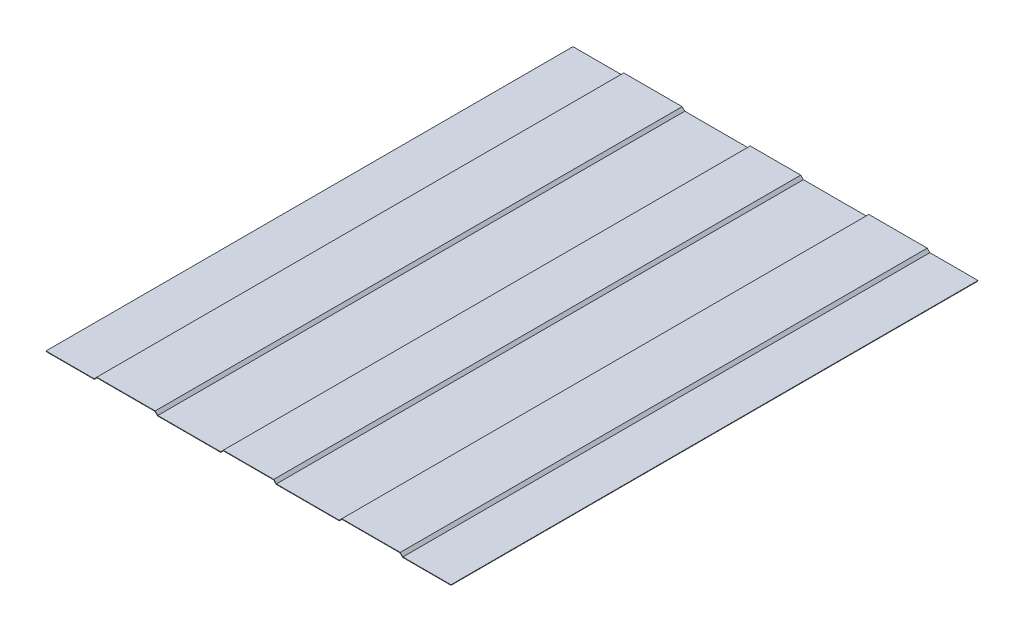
ISO-10303-21;
HEADER;
FILE_DESCRIPTION(('STEP AP214'),'2;1');
FILE_NAME('part.step','',(''),(''),'','','');
FILE_SCHEMA(('AUTOMOTIVE_DESIGN { 1 0 10303 214 1 1 1 1 }'));
ENDSEC;
DATA;
#1=APPLICATION_CONTEXT('core data for automotive mechanical design processes');
#2=APPLICATION_PROTOCOL_DEFINITION('international standard','automotive_design',2000,#1);
#3=PRODUCT_CONTEXT('',#1,'mechanical');
#4=PRODUCT('Part','Part','',(#3));
#5=PRODUCT_RELATED_PRODUCT_CATEGORY('part','',(#4));
#6=PRODUCT_DEFINITION_FORMATION('','',#4);
#7=PRODUCT_DEFINITION_CONTEXT('part definition',#1,'design');
#8=PRODUCT_DEFINITION('design','',#6,#7);
#9=PRODUCT_DEFINITION_SHAPE('','',#8);
#10=(LENGTH_UNIT() NAMED_UNIT(*) SI_UNIT(.MILLI.,.METRE.));
#11=(NAMED_UNIT(*) PLANE_ANGLE_UNIT() SI_UNIT($,.RADIAN.));
#12=(NAMED_UNIT(*) SI_UNIT($,.STERADIAN.) SOLID_ANGLE_UNIT());
#13=UNCERTAINTY_MEASURE_WITH_UNIT(LENGTH_MEASURE(1.E-05),#10,'distance_accuracy_value','');
#14=(GEOMETRIC_REPRESENTATION_CONTEXT(3) GLOBAL_UNCERTAINTY_ASSIGNED_CONTEXT((#13)) GLOBAL_UNIT_ASSIGNED_CONTEXT((#10,
#11,#12)) REPRESENTATION_CONTEXT('',''));
#15=CARTESIAN_POINT('',(0.,0.,0.));
#16=DIRECTION('',(0.,0.,1.));
#17=DIRECTION('',(1.,0.,0.));
#18=AXIS2_PLACEMENT_3D('',#15,#16,#17);
#19=CARTESIAN_POINT('',(-384.25,1.,1768.52342189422));
#20=DIRECTION('',(0.,-1.,0.));
#21=DIRECTION('',(1.,0.,0.));
#22=AXIS2_PLACEMENT_3D('',#19,#20,#21);
#23=PLANE('',#22);
#24=DIRECTION('',(-1.,0.,0.));
#25=VECTOR('',#24,1.);
#26=CARTESIAN_POINT('',(-384.250000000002,1.,999.999999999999));
#27=LINE('',#26,#25);
#28=CARTESIAN_POINT('',(-292.914213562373,1.00000000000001,999.999999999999));
#29=VERTEX_POINT('',#28);
#30=CARTESIAN_POINT('',(-384.25,1.,999.999999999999));
#31=VERTEX_POINT('',#30);
#32=EDGE_CURVE('E262',#29,#31,#27,.T.);
#33=ORIENTED_EDGE('',*,*,#32,.F.);
#34=DIRECTION('',(0.,0.,-1.));
#35=VECTOR('',#34,1.);
#36=CARTESIAN_POINT('',(-292.914213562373,1.,1768.52342189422));
#37=LINE('',#36,#35);
#38=CARTESIAN_POINT('',(-292.914213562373,1.,0.));
#39=VERTEX_POINT('',#38);
#40=EDGE_CURVE('E30',#29,#39,#37,.T.);
#41=ORIENTED_EDGE('',*,*,#40,.T.);
#42=DIRECTION('',(-1.,0.,0.));
#43=VECTOR('',#42,1.);
#44=CARTESIAN_POINT('',(-384.25,1.,0.));
#45=LINE('',#44,#43);
#46=CARTESIAN_POINT('',(-384.25,1.,0.));
#47=VERTEX_POINT('',#46);
#48=EDGE_CURVE('E306',#39,#47,#45,.T.);
#49=ORIENTED_EDGE('',*,*,#48,.T.);
#50=DIRECTION('',(0.,0.,-1.));
#51=VECTOR('',#50,1.);
#52=CARTESIAN_POINT('',(-384.25,1.,1768.52342189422));
#53=LINE('',#52,#51);
#54=EDGE_CURVE('E161',#31,#47,#53,.T.);
#55=ORIENTED_EDGE('',*,*,#54,.F.);
#56=EDGE_LOOP('',(#33,#41,#49,#55));
#57=FACE_BOUND('',#56,.T.);
#58=ADVANCED_FACE('F26',(#57),#23,.F.);
#59=CARTESIAN_POINT('',(-384.25,0.,1768.52342189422));
#60=DIRECTION('',(-1.,0.,0.));
#61=DIRECTION('',(0.,0.,1.));
#62=AXIS2_PLACEMENT_3D('',#59,#60,#61);
#63=PLANE('',#62);
#64=DIRECTION('',(0.,0.,-1.));
#65=VECTOR('',#64,1.);
#66=CARTESIAN_POINT('',(-384.25,0.,1768.52342189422));
#67=LINE('',#66,#65);
#68=CARTESIAN_POINT('',(-384.25,0.,999.999999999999));
#69=VERTEX_POINT('',#68);
#70=CARTESIAN_POINT('',(-384.25,0.,0.));
#71=VERTEX_POINT('',#70);
#72=EDGE_CURVE('E302',#69,#71,#67,.T.);
#73=ORIENTED_EDGE('',*,*,#72,.F.);
#74=DIRECTION('',(0.,1.,0.));
#75=VECTOR('',#74,1.);
#76=CARTESIAN_POINT('',(-384.25,1.06654049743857E-13,999.999999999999));
#77=LINE('',#76,#75);
#78=EDGE_CURVE('E168',#69,#31,#77,.T.);
#79=ORIENTED_EDGE('',*,*,#78,.T.);
#80=ORIENTED_EDGE('',*,*,#54,.T.);
#81=DIRECTION('',(0.,1.,0.));
#82=VECTOR('',#81,1.);
#83=CARTESIAN_POINT('',(-384.25,0.,0.));
#84=LINE('',#83,#82);
#85=EDGE_CURVE('E311',#71,#47,#84,.T.);
#86=ORIENTED_EDGE('',*,*,#85,.F.);
#87=EDGE_LOOP('',(#73,#79,#80,#86));
#88=FACE_BOUND('',#87,.T.);
#89=ADVANCED_FACE('F428',(#88),#63,.T.);
#90=CARTESIAN_POINT('',(-384.25,0.,1768.52342189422));
#91=DIRECTION('',(0.,-1.,0.));
#92=DIRECTION('',(1.,0.,0.));
#93=AXIS2_PLACEMENT_3D('',#90,#91,#92);
#94=PLANE('',#93);
#95=DIRECTION('',(0.,0.,-1.));
#96=VECTOR('',#95,1.);
#97=CARTESIAN_POINT('',(-292.5,0.,1768.52342189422));
#98=LINE('',#97,#96);
#99=CARTESIAN_POINT('',(-292.5,0.,999.999999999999));
#100=VERTEX_POINT('',#99);
#101=CARTESIAN_POINT('',(-292.5,0.,0.));
#102=VERTEX_POINT('',#101);
#103=EDGE_CURVE('E299',#100,#102,#98,.T.);
#104=ORIENTED_EDGE('',*,*,#103,.F.);
#105=DIRECTION('',(-1.,0.,0.));
#106=VECTOR('',#105,1.);
#107=CARTESIAN_POINT('',(-384.250000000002,0.,999.999999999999));
#108=LINE('',#107,#106);
#109=EDGE_CURVE('E303',#100,#69,#108,.T.);
#110=ORIENTED_EDGE('',*,*,#109,.T.);
#111=ORIENTED_EDGE('',*,*,#72,.T.);
#112=DIRECTION('',(-1.,0.,0.));
#113=VECTOR('',#112,1.);
#114=CARTESIAN_POINT('',(-384.25,0.,0.));
#115=LINE('',#114,#113);
#116=EDGE_CURVE('E418',#102,#71,#115,.T.);
#117=ORIENTED_EDGE('',*,*,#116,.F.);
#118=EDGE_LOOP('',(#104,#110,#111,#117));
#119=FACE_BOUND('',#118,.T.);
#120=ADVANCED_FACE('F434',(#119),#94,.T.);
#121=CARTESIAN_POINT('',(-292.5,0.,1768.52342189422));
#122=DIRECTION('',(0.707106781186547,-0.707106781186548,0.));
#123=DIRECTION('',(0.707106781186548,0.707106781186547,0.));
#124=AXIS2_PLACEMENT_3D('',#121,#122,#123);
#125=PLANE('',#124);
#126=DIRECTION('',(0.,0.,-1.));
#127=VECTOR('',#126,1.);
#128=CARTESIAN_POINT('',(-287.5,5.,1768.52342189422));
#129=LINE('',#128,#127);
#130=CARTESIAN_POINT('',(-287.5,5.,999.999999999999));
#131=VERTEX_POINT('',#130);
#132=CARTESIAN_POINT('',(-287.5,5.,0.));
#133=VERTEX_POINT('',#132);
#134=EDGE_CURVE('E296',#131,#133,#129,.T.);
#135=ORIENTED_EDGE('',*,*,#134,.F.);
#136=DIRECTION('',(-0.707106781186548,-0.707106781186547,0.));
#137=VECTOR('',#136,1.);
#138=CARTESIAN_POINT('',(-292.500000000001,-8.77850298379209E-13,999.999999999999));
#139=LINE('',#138,#137);
#140=EDGE_CURVE('E300',#131,#100,#139,.T.);
#141=ORIENTED_EDGE('',*,*,#140,.T.);
#142=ORIENTED_EDGE('',*,*,#103,.T.);
#143=DIRECTION('',(-0.707106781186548,-0.707106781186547,0.));
#144=VECTOR('',#143,1.);
#145=CARTESIAN_POINT('',(-292.5,0.,0.));
#146=LINE('',#145,#144);
#147=EDGE_CURVE('E415',#133,#102,#146,.T.);
#148=ORIENTED_EDGE('',*,*,#147,.F.);
#149=EDGE_LOOP('',(#135,#141,#142,#148));
#150=FACE_BOUND('',#149,.T.);
#151=ADVANCED_FACE('F438',(#150),#125,.T.);
#152=CARTESIAN_POINT('',(-287.5,5.,1768.52342189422));
#153=DIRECTION('',(0.,-1.,0.));
#154=DIRECTION('',(0.,0.,-1.));
#155=AXIS2_PLACEMENT_3D('',#152,#153,#154);
#156=PLANE('',#155);
#157=DIRECTION('',(0.,0.,-1.));
#158=VECTOR('',#157,1.);
#159=CARTESIAN_POINT('',(-177.5,5.,1768.52342189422));
#160=LINE('',#159,#158);
#161=CARTESIAN_POINT('',(-177.5,5.,999.999999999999));
#162=VERTEX_POINT('',#161);
#163=CARTESIAN_POINT('',(-177.5,5.,0.));
#164=VERTEX_POINT('',#163);
#165=EDGE_CURVE('E293',#162,#164,#160,.T.);
#166=ORIENTED_EDGE('',*,*,#165,.F.);
#167=DIRECTION('',(-1.,0.,0.));
#168=VECTOR('',#167,1.);
#169=CARTESIAN_POINT('',(-287.500000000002,5.,999.999999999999));
#170=LINE('',#169,#168);
#171=EDGE_CURVE('E297',#162,#131,#170,.T.);
#172=ORIENTED_EDGE('',*,*,#171,.T.);
#173=ORIENTED_EDGE('',*,*,#134,.T.);
#174=DIRECTION('',(-1.,0.,0.));
#175=VECTOR('',#174,1.);
#176=CARTESIAN_POINT('',(-287.5,5.,0.));
#177=LINE('',#176,#175);
#178=EDGE_CURVE('E412',#164,#133,#177,.T.);
#179=ORIENTED_EDGE('',*,*,#178,.F.);
#180=EDGE_LOOP('',(#166,#172,#173,#179));
#181=FACE_BOUND('',#180,.T.);
#182=ADVANCED_FACE('F442',(#181),#156,.T.);
#183=CARTESIAN_POINT('',(-177.5,5.,1768.52342189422));
#184=DIRECTION('',(-0.707106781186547,-0.707106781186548,0.));
#185=DIRECTION('',(0.707106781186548,-0.707106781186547,0.));
#186=AXIS2_PLACEMENT_3D('',#183,#184,#185);
#187=PLANE('',#186);
#188=DIRECTION('',(0.,0.,-1.));
#189=VECTOR('',#188,1.);
#190=CARTESIAN_POINT('',(-172.5,0.,1768.52342189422));
#191=LINE('',#190,#189);
#192=CARTESIAN_POINT('',(-172.5,0.,999.999999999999));
#193=VERTEX_POINT('',#192);
#194=CARTESIAN_POINT('',(-172.5,0.,0.));
#195=VERTEX_POINT('',#194);
#196=EDGE_CURVE('E290',#193,#195,#191,.T.);
#197=ORIENTED_EDGE('',*,*,#196,.F.);
#198=DIRECTION('',(-0.707106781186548,0.707106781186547,0.));
#199=VECTOR('',#198,1.);
#200=CARTESIAN_POINT('',(-177.500000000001,5.00000000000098,999.999999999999));
#201=LINE('',#200,#199);
#202=EDGE_CURVE('E294',#193,#162,#201,.T.);
#203=ORIENTED_EDGE('',*,*,#202,.T.);
#204=ORIENTED_EDGE('',*,*,#165,.T.);
#205=DIRECTION('',(-0.707106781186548,0.707106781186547,0.));
#206=VECTOR('',#205,1.);
#207=CARTESIAN_POINT('',(-177.5,5.,0.));
#208=LINE('',#207,#206);
#209=EDGE_CURVE('E409',#195,#164,#208,.T.);
#210=ORIENTED_EDGE('',*,*,#209,.F.);
#211=EDGE_LOOP('',(#197,#203,#204,#210));
#212=FACE_BOUND('',#211,.T.);
#213=ADVANCED_FACE('F448',(#212),#187,.T.);
#214=CARTESIAN_POINT('',(-172.5,0.,1768.52342189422));
#215=DIRECTION('',(0.,-1.,0.));
#216=DIRECTION('',(0.,0.,-1.));
#217=AXIS2_PLACEMENT_3D('',#214,#215,#216);
#218=PLANE('',#217);
#219=DIRECTION('',(0.,0.,-1.));
#220=VECTOR('',#219,1.);
#221=CARTESIAN_POINT('',(-52.5,0.,1768.52342189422));
#222=LINE('',#221,#220);
#223=CARTESIAN_POINT('',(-52.5,0.,999.999999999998));
#224=VERTEX_POINT('',#223);
#225=CARTESIAN_POINT('',(-52.5,0.,0.));
#226=VERTEX_POINT('',#225);
#227=EDGE_CURVE('E287',#224,#226,#222,.T.);
#228=ORIENTED_EDGE('',*,*,#227,.F.);
#229=DIRECTION('',(-1.,0.,0.));
#230=VECTOR('',#229,1.);
#231=CARTESIAN_POINT('',(-172.500000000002,0.,999.999999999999));
#232=LINE('',#231,#230);
#233=EDGE_CURVE('E291',#224,#193,#232,.T.);
#234=ORIENTED_EDGE('',*,*,#233,.T.);
#235=ORIENTED_EDGE('',*,*,#196,.T.);
#236=DIRECTION('',(-1.,0.,0.));
#237=VECTOR('',#236,1.);
#238=CARTESIAN_POINT('',(-172.5,0.,0.));
#239=LINE('',#238,#237);
#240=EDGE_CURVE('E406',#226,#195,#239,.T.);
#241=ORIENTED_EDGE('',*,*,#240,.F.);
#242=EDGE_LOOP('',(#228,#234,#235,#241));
#243=FACE_BOUND('',#242,.T.);
#244=ADVANCED_FACE('F453',(#243),#218,.T.);
#245=CARTESIAN_POINT('',(-52.5,0.,1768.52342189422));
#246=DIRECTION('',(0.707106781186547,-0.707106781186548,0.));
#247=DIRECTION('',(0.707106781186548,0.707106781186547,0.));
#248=AXIS2_PLACEMENT_3D('',#245,#246,#247);
#249=PLANE('',#248);
#250=DIRECTION('',(0.,0.,-1.));
#251=VECTOR('',#250,1.);
#252=CARTESIAN_POINT('',(-47.5,5.,1768.52342189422));
#253=LINE('',#252,#251);
#254=CARTESIAN_POINT('',(-47.5,5.,999.999999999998));
#255=VERTEX_POINT('',#254);
#256=CARTESIAN_POINT('',(-47.5,5.,0.));
#257=VERTEX_POINT('',#256);
#258=EDGE_CURVE('E284',#255,#257,#253,.T.);
#259=ORIENTED_EDGE('',*,*,#258,.F.);
#260=DIRECTION('',(-0.707106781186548,-0.707106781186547,0.));
#261=VECTOR('',#260,1.);
#262=CARTESIAN_POINT('',(-52.5000000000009,-8.7785029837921E-13,999.999999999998));
#263=LINE('',#262,#261);
#264=EDGE_CURVE('E288',#255,#224,#263,.T.);
#265=ORIENTED_EDGE('',*,*,#264,.T.);
#266=ORIENTED_EDGE('',*,*,#227,.T.);
#267=DIRECTION('',(-0.707106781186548,-0.707106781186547,0.));
#268=VECTOR('',#267,1.);
#269=CARTESIAN_POINT('',(-52.5,0.,0.));
#270=LINE('',#269,#268);
#271=EDGE_CURVE('E403',#257,#226,#270,.T.);
#272=ORIENTED_EDGE('',*,*,#271,.F.);
#273=EDGE_LOOP('',(#259,#265,#266,#272));
#274=FACE_BOUND('',#273,.T.);
#275=ADVANCED_FACE('F457',(#274),#249,.T.);
#276=CARTESIAN_POINT('',(-47.5,5.,1768.52342189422));
#277=DIRECTION('',(0.,-1.,0.));
#278=DIRECTION('',(1.,0.,0.));
#279=AXIS2_PLACEMENT_3D('',#276,#277,#278);
#280=PLANE('',#279);
#281=DIRECTION('',(0.,0.,-1.));
#282=VECTOR('',#281,1.);
#283=CARTESIAN_POINT('',(47.5,5.,1768.52342189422));
#284=LINE('',#283,#282);
#285=CARTESIAN_POINT('',(47.5,5.,999.999999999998));
#286=VERTEX_POINT('',#285);
#287=CARTESIAN_POINT('',(47.5,5.,0.));
#288=VERTEX_POINT('',#287);
#289=EDGE_CURVE('E281',#286,#288,#284,.T.);
#290=ORIENTED_EDGE('',*,*,#289,.F.);
#291=DIRECTION('',(-1.,0.,0.));
#292=VECTOR('',#291,1.);
#293=CARTESIAN_POINT('',(-47.5000000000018,5.,999.999999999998));
#294=LINE('',#293,#292);
#295=EDGE_CURVE('E285',#286,#255,#294,.T.);
#296=ORIENTED_EDGE('',*,*,#295,.T.);
#297=ORIENTED_EDGE('',*,*,#258,.T.);
#298=DIRECTION('',(-1.,0.,0.));
#299=VECTOR('',#298,1.);
#300=CARTESIAN_POINT('',(-47.5,5.,0.));
#301=LINE('',#300,#299);
#302=EDGE_CURVE('E400',#288,#257,#301,.T.);
#303=ORIENTED_EDGE('',*,*,#302,.F.);
#304=EDGE_LOOP('',(#290,#296,#297,#303));
#305=FACE_BOUND('',#304,.T.);
#306=ADVANCED_FACE('F463',(#305),#280,.T.);
#307=CARTESIAN_POINT('',(52.5,0.,1768.52342189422));
#308=DIRECTION('',(-0.707106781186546,-0.707106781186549,0.));
#309=DIRECTION('',(0.707106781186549,-0.707106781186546,0.));
#310=AXIS2_PLACEMENT_3D('',#307,#308,#309);
#311=PLANE('',#310);
#312=DIRECTION('',(0.,0.,-1.));
#313=VECTOR('',#312,1.);
#314=CARTESIAN_POINT('',(52.5,0.,1768.52342189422));
#315=LINE('',#314,#313);
#316=CARTESIAN_POINT('',(52.5,0.,999.999999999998));
#317=VERTEX_POINT('',#316);
#318=CARTESIAN_POINT('',(52.5,0.,0.));
#319=VERTEX_POINT('',#318);
#320=EDGE_CURVE('E278',#317,#319,#315,.T.);
#321=ORIENTED_EDGE('',*,*,#320,.F.);
#322=DIRECTION('',(-0.707106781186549,0.707106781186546,0.));
#323=VECTOR('',#322,1.);
#324=CARTESIAN_POINT('',(52.499999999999,9.91443242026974E-13,999.999999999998));
#325=LINE('',#324,#323);
#326=EDGE_CURVE('E282',#317,#286,#325,.T.);
#327=ORIENTED_EDGE('',*,*,#326,.T.);
#328=ORIENTED_EDGE('',*,*,#289,.T.);
#329=DIRECTION('',(-0.707106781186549,0.707106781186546,0.));
#330=VECTOR('',#329,1.);
#331=CARTESIAN_POINT('',(52.5,0.,0.));
#332=LINE('',#331,#330);
#333=EDGE_CURVE('E397',#319,#288,#332,.T.);
#334=ORIENTED_EDGE('',*,*,#333,.F.);
#335=EDGE_LOOP('',(#321,#327,#328,#334));
#336=FACE_BOUND('',#335,.T.);
#337=ADVANCED_FACE('F468',(#336),#311,.T.);
#338=CARTESIAN_POINT('',(172.5,0.,1768.52342189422));
#339=DIRECTION('',(0.,-1.,0.));
#340=DIRECTION('',(0.,0.,-1.));
#341=AXIS2_PLACEMENT_3D('',#338,#339,#340);
#342=PLANE('',#341);
#343=DIRECTION('',(0.,0.,-1.));
#344=VECTOR('',#343,1.);
#345=CARTESIAN_POINT('',(172.5,0.,1768.52342189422));
#346=LINE('',#345,#344);
#347=CARTESIAN_POINT('',(172.5,0.,999.999999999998));
#348=VERTEX_POINT('',#347);
#349=CARTESIAN_POINT('',(172.5,0.,0.));
#350=VERTEX_POINT('',#349);
#351=EDGE_CURVE('E275',#348,#350,#346,.T.);
#352=ORIENTED_EDGE('',*,*,#351,.F.);
#353=DIRECTION('',(-1.,0.,0.));
#354=VECTOR('',#353,1.);
#355=CARTESIAN_POINT('',(172.499999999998,0.,999.999999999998));
#356=LINE('',#355,#354);
#357=EDGE_CURVE('E279',#348,#317,#356,.T.);
#358=ORIENTED_EDGE('',*,*,#357,.T.);
#359=ORIENTED_EDGE('',*,*,#320,.T.);
#360=DIRECTION('',(-1.,0.,0.));
#361=VECTOR('',#360,1.);
#362=CARTESIAN_POINT('',(172.5,0.,0.));
#363=LINE('',#362,#361);
#364=EDGE_CURVE('E394',#350,#319,#363,.T.);
#365=ORIENTED_EDGE('',*,*,#364,.F.);
#366=EDGE_LOOP('',(#352,#358,#359,#365));
#367=FACE_BOUND('',#366,.T.);
#368=ADVANCED_FACE('F472',(#367),#342,.T.);
#369=CARTESIAN_POINT('',(177.5,5.,1768.52342189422));
#370=DIRECTION('',(0.707106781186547,-0.707106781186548,0.));
#371=DIRECTION('',(0.707106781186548,0.707106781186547,0.));
#372=AXIS2_PLACEMENT_3D('',#369,#370,#371);
#373=PLANE('',#372);
#374=DIRECTION('',(0.,0.,-1.));
#375=VECTOR('',#374,1.);
#376=CARTESIAN_POINT('',(177.5,5.,1768.52342189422));
#377=LINE('',#376,#375);
#378=CARTESIAN_POINT('',(177.5,5.,999.999999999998));
#379=VERTEX_POINT('',#378);
#380=CARTESIAN_POINT('',(177.5,5.,0.));
#381=VERTEX_POINT('',#380);
#382=EDGE_CURVE('E272',#379,#381,#377,.T.);
#383=ORIENTED_EDGE('',*,*,#382,.F.);
#384=DIRECTION('',(-0.707106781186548,-0.707106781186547,0.));
#385=VECTOR('',#384,1.);
#386=CARTESIAN_POINT('',(177.499999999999,4.99999999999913,999.999999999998));
#387=LINE('',#386,#385);
#388=EDGE_CURVE('E276',#379,#348,#387,.T.);
#389=ORIENTED_EDGE('',*,*,#388,.T.);
#390=ORIENTED_EDGE('',*,*,#351,.T.);
#391=DIRECTION('',(-0.707106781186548,-0.707106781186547,0.));
#392=VECTOR('',#391,1.);
#393=CARTESIAN_POINT('',(177.5,5.,0.));
#394=LINE('',#393,#392);
#395=EDGE_CURVE('E391',#381,#350,#394,.T.);
#396=ORIENTED_EDGE('',*,*,#395,.F.);
#397=EDGE_LOOP('',(#383,#389,#390,#396));
#398=FACE_BOUND('',#397,.T.);
#399=ADVANCED_FACE('F478',(#398),#373,.T.);
#400=CARTESIAN_POINT('',(287.5,5.,1768.52342189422));
#401=DIRECTION('',(0.,-1.,0.));
#402=DIRECTION('',(0.,0.,-1.));
#403=AXIS2_PLACEMENT_3D('',#400,#401,#402);
#404=PLANE('',#403);
#405=DIRECTION('',(0.,0.,-1.));
#406=VECTOR('',#405,1.);
#407=CARTESIAN_POINT('',(287.5,5.,1768.52342189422));
#408=LINE('',#407,#406);
#409=CARTESIAN_POINT('',(287.5,5.,999.999999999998));
#410=VERTEX_POINT('',#409);
#411=CARTESIAN_POINT('',(287.5,5.,0.));
#412=VERTEX_POINT('',#411);
#413=EDGE_CURVE('E269',#410,#412,#408,.T.);
#414=ORIENTED_EDGE('',*,*,#413,.F.);
#415=DIRECTION('',(-1.,0.,0.));
#416=VECTOR('',#415,1.);
#417=CARTESIAN_POINT('',(287.499999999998,5.,999.999999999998));
#418=LINE('',#417,#416);
#419=EDGE_CURVE('E273',#410,#379,#418,.T.);
#420=ORIENTED_EDGE('',*,*,#419,.T.);
#421=ORIENTED_EDGE('',*,*,#382,.T.);
#422=DIRECTION('',(-1.,0.,0.));
#423=VECTOR('',#422,1.);
#424=CARTESIAN_POINT('',(287.5,5.,0.));
#425=LINE('',#424,#423);
#426=EDGE_CURVE('E388',#412,#381,#425,.T.);
#427=ORIENTED_EDGE('',*,*,#426,.F.);
#428=EDGE_LOOP('',(#414,#420,#421,#427));
#429=FACE_BOUND('',#428,.T.);
#430=ADVANCED_FACE('F483',(#429),#404,.T.);
#431=CARTESIAN_POINT('',(292.5,0.,1768.52342189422));
#432=DIRECTION('',(-0.707106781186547,-0.707106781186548,0.));
#433=DIRECTION('',(0.707106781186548,-0.707106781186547,0.));
#434=AXIS2_PLACEMENT_3D('',#431,#432,#433);
#435=PLANE('',#434);
#436=DIRECTION('',(0.,0.,-1.));
#437=VECTOR('',#436,1.);
#438=CARTESIAN_POINT('',(292.5,0.,1768.52342189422));
#439=LINE('',#438,#437);
#440=CARTESIAN_POINT('',(292.5,0.,999.999999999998));
#441=VERTEX_POINT('',#440);
#442=CARTESIAN_POINT('',(292.5,0.,0.));
#443=VERTEX_POINT('',#442);
#444=EDGE_CURVE('E266',#441,#443,#439,.T.);
#445=ORIENTED_EDGE('',*,*,#444,.F.);
#446=DIRECTION('',(-0.707106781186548,0.707106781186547,0.));
#447=VECTOR('',#446,1.);
#448=CARTESIAN_POINT('',(292.499999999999,9.91443242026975E-13,999.999999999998));
#449=LINE('',#448,#447);
#450=EDGE_CURVE('E270',#441,#410,#449,.T.);
#451=ORIENTED_EDGE('',*,*,#450,.T.);
#452=ORIENTED_EDGE('',*,*,#413,.T.);
#453=DIRECTION('',(-0.707106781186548,0.707106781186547,0.));
#454=VECTOR('',#453,1.);
#455=CARTESIAN_POINT('',(292.5,0.,0.));
#456=LINE('',#455,#454);
#457=EDGE_CURVE('E385',#443,#412,#456,.T.);
#458=ORIENTED_EDGE('',*,*,#457,.F.);
#459=EDGE_LOOP('',(#445,#451,#452,#458));
#460=FACE_BOUND('',#459,.T.);
#461=ADVANCED_FACE('F487',(#460),#435,.T.);
#462=CARTESIAN_POINT('',(384.25,0.,1768.52342189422));
#463=DIRECTION('',(0.,-1.,0.));
#464=DIRECTION('',(1.,0.,0.));
#465=AXIS2_PLACEMENT_3D('',#462,#463,#464);
#466=PLANE('',#465);
#467=DIRECTION('',(0.,0.,-1.));
#468=VECTOR('',#467,1.);
#469=CARTESIAN_POINT('',(384.25,0.,1768.52342189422));
#470=LINE('',#469,#468);
#471=CARTESIAN_POINT('',(384.25,0.,999.999999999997));
#472=VERTEX_POINT('',#471);
#473=CARTESIAN_POINT('',(384.25,0.,0.));
#474=VERTEX_POINT('',#473);
#475=EDGE_CURVE('E265',#472,#474,#470,.T.);
#476=ORIENTED_EDGE('',*,*,#475,.F.);
#477=DIRECTION('',(-1.,0.,0.));
#478=VECTOR('',#477,1.);
#479=CARTESIAN_POINT('',(384.249999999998,0.,999.999999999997));
#480=LINE('',#479,#478);
#481=EDGE_CURVE('E267',#472,#441,#480,.T.);
#482=ORIENTED_EDGE('',*,*,#481,.T.);
#483=ORIENTED_EDGE('',*,*,#444,.T.);
#484=DIRECTION('',(-1.,0.,0.));
#485=VECTOR('',#484,1.);
#486=CARTESIAN_POINT('',(384.25,0.,0.));
#487=LINE('',#486,#485);
#488=EDGE_CURVE('E382',#474,#443,#487,.T.);
#489=ORIENTED_EDGE('',*,*,#488,.F.);
#490=EDGE_LOOP('',(#476,#482,#483,#489));
#491=FACE_BOUND('',#490,.T.);
#492=ADVANCED_FACE('F492',(#491),#466,.T.);
#493=CARTESIAN_POINT('',(384.25,1.00000000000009,1768.52342189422));
#494=DIRECTION('',(1.,0.,0.));
#495=DIRECTION('',(0.,0.,-1.));
#496=AXIS2_PLACEMENT_3D('',#493,#494,#495);
#497=PLANE('',#496);
#498=DIRECTION('',(0.,0.,-1.));
#499=VECTOR('',#498,1.);
#500=CARTESIAN_POINT('',(384.25,1.00000000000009,1768.52342189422));
#501=LINE('',#500,#499);
#502=CARTESIAN_POINT('',(384.25,1.00000000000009,999.999999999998));
#503=VERTEX_POINT('',#502);
#504=CARTESIAN_POINT('',(384.25,1.00000000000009,0.));
#505=VERTEX_POINT('',#504);
#506=EDGE_CURVE('E327',#503,#505,#501,.T.);
#507=ORIENTED_EDGE('',*,*,#506,.F.);
#508=DIRECTION('',(0.,-1.,0.));
#509=VECTOR('',#508,1.);
#510=CARTESIAN_POINT('',(384.25,1.0000000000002,999.999999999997));
#511=LINE('',#510,#509);
#512=EDGE_CURVE('E263',#503,#472,#511,.T.);
#513=ORIENTED_EDGE('',*,*,#512,.T.);
#514=ORIENTED_EDGE('',*,*,#475,.T.);
#515=DIRECTION('',(0.,-1.,0.));
#516=VECTOR('',#515,1.);
#517=CARTESIAN_POINT('',(384.25,1.00000000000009,0.));
#518=LINE('',#517,#516);
#519=EDGE_CURVE('E356',#505,#474,#518,.T.);
#520=ORIENTED_EDGE('',*,*,#519,.F.);
#521=EDGE_LOOP('',(#507,#513,#514,#520));
#522=FACE_BOUND('',#521,.T.);
#523=ADVANCED_FACE('F497',(#522),#497,.T.);
#524=CARTESIAN_POINT('',(384.25,1.00000000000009,1768.52342189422));
#525=DIRECTION('',(0.,-1.,0.));
#526=DIRECTION('',(1.,0.,0.));
#527=AXIS2_PLACEMENT_3D('',#524,#525,#526);
#528=PLANE('',#527);
#529=DIRECTION('',(-1.,0.,0.));
#530=VECTOR('',#529,1.);
#531=CARTESIAN_POINT('',(384.249999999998,1.00000000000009,999.999999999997));
#532=LINE('',#531,#530);
#533=CARTESIAN_POINT('',(292.914213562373,1.,999.999999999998));
#534=VERTEX_POINT('',#533);
#535=EDGE_CURVE('E259',#503,#534,#532,.T.);
#536=ORIENTED_EDGE('',*,*,#535,.F.);
#537=ORIENTED_EDGE('',*,*,#506,.T.);
#538=DIRECTION('',(-1.,0.,0.));
#539=VECTOR('',#538,1.);
#540=CARTESIAN_POINT('',(384.25,1.00000000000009,0.));
#541=LINE('',#540,#539);
#542=CARTESIAN_POINT('',(292.914213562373,1.,0.));
#543=VERTEX_POINT('',#542);
#544=EDGE_CURVE('E329',#505,#543,#541,.T.);
#545=ORIENTED_EDGE('',*,*,#544,.T.);
#546=DIRECTION('',(0.,0.,-1.));
#547=VECTOR('',#546,1.);
#548=CARTESIAN_POINT('',(292.914213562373,1.,1768.52342189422));
#549=LINE('',#548,#547);
#550=EDGE_CURVE('E330',#534,#543,#549,.T.);
#551=ORIENTED_EDGE('',*,*,#550,.F.);
#552=EDGE_LOOP('',(#536,#537,#545,#551));
#553=FACE_BOUND('',#552,.T.);
#554=ADVANCED_FACE('F500',(#553),#528,.F.);
#555=CARTESIAN_POINT('',(293.207106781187,0.707106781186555,1768.52342189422));
#556=DIRECTION('',(-0.707106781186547,-0.707106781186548,0.));
#557=DIRECTION('',(0.707106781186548,-0.707106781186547,0.));
#558=AXIS2_PLACEMENT_3D('',#555,#556,#557);
#559=PLANE('',#558);
#560=DIRECTION('',(-0.707106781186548,0.707106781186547,0.));
#561=VECTOR('',#560,1.);
#562=CARTESIAN_POINT('',(293.207106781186,0.707106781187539,999.999999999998));
#563=LINE('',#562,#561);
#564=CARTESIAN_POINT('',(287.914213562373,6.,999.999999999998));
#565=VERTEX_POINT('',#564);
#566=EDGE_CURVE('E256',#534,#565,#563,.T.);
#567=ORIENTED_EDGE('',*,*,#566,.F.);
#568=ORIENTED_EDGE('',*,*,#550,.T.);
#569=DIRECTION('',(-0.707106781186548,0.707106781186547,0.));
#570=VECTOR('',#569,1.);
#571=CARTESIAN_POINT('',(293.207106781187,0.707106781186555,0.));
#572=LINE('',#571,#570);
#573=CARTESIAN_POINT('',(287.914213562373,6.,0.));
#574=VERTEX_POINT('',#573);
#575=EDGE_CURVE('E332',#543,#574,#572,.T.);
#576=ORIENTED_EDGE('',*,*,#575,.T.);
#577=DIRECTION('',(0.,0.,-1.));
#578=VECTOR('',#577,1.);
#579=CARTESIAN_POINT('',(287.914213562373,6.,1768.52342189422));
#580=LINE('',#579,#578);
#581=EDGE_CURVE('E333',#565,#574,#580,.T.);
#582=ORIENTED_EDGE('',*,*,#581,.F.);
#583=EDGE_LOOP('',(#567,#568,#576,#582));
#584=FACE_BOUND('',#583,.T.);
#585=ADVANCED_FACE('F507',(#584),#559,.F.);
#586=CARTESIAN_POINT('',(287.5,6.,1768.52342189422));
#587=DIRECTION('',(0.,-1.,0.));
#588=DIRECTION('',(0.,0.,-1.));
#589=AXIS2_PLACEMENT_3D('',#586,#587,#588);
#590=PLANE('',#589);
#591=DIRECTION('',(-1.,0.,0.));
#592=VECTOR('',#591,1.);
#593=CARTESIAN_POINT('',(287.499999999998,6.,999.999999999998));
#594=LINE('',#593,#592);
#595=CARTESIAN_POINT('',(177.085786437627,6.,999.999999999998));
#596=VERTEX_POINT('',#595);
#597=EDGE_CURVE('E253',#565,#596,#594,.T.);
#598=ORIENTED_EDGE('',*,*,#597,.F.);
#599=ORIENTED_EDGE('',*,*,#581,.T.);
#600=DIRECTION('',(1.,0.,0.));
#601=VECTOR('',#600,1.);
#602=CARTESIAN_POINT('',(287.5,6.,0.));
#603=LINE('',#602,#601);
#604=CARTESIAN_POINT('',(177.085786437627,6.,0.));
#605=VERTEX_POINT('',#604);
#606=EDGE_CURVE('E335',#574,#605,#603,.F.);
#607=ORIENTED_EDGE('',*,*,#606,.T.);
#608=DIRECTION('',(0.,0.,-1.));
#609=VECTOR('',#608,1.);
#610=CARTESIAN_POINT('',(177.085786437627,6.,1768.52342189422));
#611=LINE('',#610,#609);
#612=EDGE_CURVE('E336',#596,#605,#611,.T.);
#613=ORIENTED_EDGE('',*,*,#612,.F.);
#614=EDGE_LOOP('',(#598,#599,#607,#613));
#615=FACE_BOUND('',#614,.T.);
#616=ADVANCED_FACE('F510',(#615),#590,.F.);
#617=CARTESIAN_POINT('',(176.792893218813,5.70710678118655,1768.52342189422));
#618=DIRECTION('',(0.707106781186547,-0.707106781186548,0.));
#619=DIRECTION('',(0.707106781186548,0.707106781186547,0.));
#620=AXIS2_PLACEMENT_3D('',#617,#618,#619);
#621=PLANE('',#620);
#622=DIRECTION('',(-0.707106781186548,-0.707106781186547,0.));
#623=VECTOR('',#622,1.);
#624=CARTESIAN_POINT('',(176.792893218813,5.70710678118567,999.999999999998));
#625=LINE('',#624,#623);
#626=CARTESIAN_POINT('',(172.085786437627,1.00000000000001,999.999999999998));
#627=VERTEX_POINT('',#626);
#628=EDGE_CURVE('E250',#596,#627,#625,.T.);
#629=ORIENTED_EDGE('',*,*,#628,.F.);
#630=ORIENTED_EDGE('',*,*,#612,.T.);
#631=DIRECTION('',(-0.707106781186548,-0.707106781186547,0.));
#632=VECTOR('',#631,1.);
#633=CARTESIAN_POINT('',(176.792893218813,5.70710678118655,0.));
#634=LINE('',#633,#632);
#635=CARTESIAN_POINT('',(172.085786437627,1.00000000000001,0.));
#636=VERTEX_POINT('',#635);
#637=EDGE_CURVE('E338',#605,#636,#634,.T.);
#638=ORIENTED_EDGE('',*,*,#637,.T.);
#639=DIRECTION('',(0.,0.,-1.));
#640=VECTOR('',#639,1.);
#641=CARTESIAN_POINT('',(172.085786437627,1.00000000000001,1768.52342189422));
#642=LINE('',#641,#640);
#643=EDGE_CURVE('E339',#627,#636,#642,.T.);
#644=ORIENTED_EDGE('',*,*,#643,.F.);
#645=EDGE_LOOP('',(#629,#630,#638,#644));
#646=FACE_BOUND('',#645,.T.);
#647=ADVANCED_FACE('F512',(#646),#621,.F.);
#648=CARTESIAN_POINT('',(172.5,1.00000000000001,1768.52342189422));
#649=DIRECTION('',(0.,-1.,0.));
#650=DIRECTION('',(0.,0.,-1.));
#651=AXIS2_PLACEMENT_3D('',#648,#649,#650);
#652=PLANE('',#651);
#653=DIRECTION('',(-1.,0.,0.));
#654=VECTOR('',#653,1.);
#655=CARTESIAN_POINT('',(172.499999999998,1.00000000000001,999.999999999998));
#656=LINE('',#655,#654);
#657=CARTESIAN_POINT('',(52.9142135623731,1.00000000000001,999.999999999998));
#658=VERTEX_POINT('',#657);
#659=EDGE_CURVE('E247',#627,#658,#656,.T.);
#660=ORIENTED_EDGE('',*,*,#659,.F.);
#661=ORIENTED_EDGE('',*,*,#643,.T.);
#662=DIRECTION('',(1.,0.,0.));
#663=VECTOR('',#662,1.);
#664=CARTESIAN_POINT('',(172.5,1.00000000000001,0.));
#665=LINE('',#664,#663);
#666=CARTESIAN_POINT('',(52.9142135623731,1.00000000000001,0.));
#667=VERTEX_POINT('',#666);
#668=EDGE_CURVE('E341',#636,#667,#665,.F.);
#669=ORIENTED_EDGE('',*,*,#668,.T.);
#670=DIRECTION('',(0.,0.,-1.));
#671=VECTOR('',#670,1.);
#672=CARTESIAN_POINT('',(52.9142135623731,1.00000000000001,1768.52342189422));
#673=LINE('',#672,#671);
#674=EDGE_CURVE('E342',#658,#667,#673,.T.);
#675=ORIENTED_EDGE('',*,*,#674,.F.);
#676=EDGE_LOOP('',(#660,#661,#669,#675));
#677=FACE_BOUND('',#676,.T.);
#678=ADVANCED_FACE('F516',(#677),#652,.F.);
#679=CARTESIAN_POINT('',(53.2071067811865,0.707106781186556,1768.52342189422));
#680=DIRECTION('',(-0.707106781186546,-0.707106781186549,0.));
#681=DIRECTION('',(0.707106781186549,-0.707106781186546,0.));
#682=AXIS2_PLACEMENT_3D('',#679,#680,#681);
#683=PLANE('',#682);
#684=DIRECTION('',(-0.707106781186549,0.707106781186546,0.));
#685=VECTOR('',#684,1.);
#686=CARTESIAN_POINT('',(53.2071067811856,0.70710678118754,999.999999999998));
#687=LINE('',#686,#685);
#688=CARTESIAN_POINT('',(47.9142135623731,6.,999.999999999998));
#689=VERTEX_POINT('',#688);
#690=EDGE_CURVE('E244',#658,#689,#687,.T.);
#691=ORIENTED_EDGE('',*,*,#690,.F.);
#692=ORIENTED_EDGE('',*,*,#674,.T.);
#693=DIRECTION('',(-0.707106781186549,0.707106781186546,0.));
#694=VECTOR('',#693,1.);
#695=CARTESIAN_POINT('',(53.2071067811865,0.707106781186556,0.));
#696=LINE('',#695,#694);
#697=CARTESIAN_POINT('',(47.9142135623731,6.,0.));
#698=VERTEX_POINT('',#697);
#699=EDGE_CURVE('E344',#667,#698,#696,.T.);
#700=ORIENTED_EDGE('',*,*,#699,.T.);
#701=DIRECTION('',(0.,0.,-1.));
#702=VECTOR('',#701,1.);
#703=CARTESIAN_POINT('',(47.9142135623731,6.,1768.52342189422));
#704=LINE('',#703,#702);
#705=EDGE_CURVE('E345',#689,#698,#704,.T.);
#706=ORIENTED_EDGE('',*,*,#705,.F.);
#707=EDGE_LOOP('',(#691,#692,#700,#706));
#708=FACE_BOUND('',#707,.T.);
#709=ADVANCED_FACE('F521',(#708),#683,.F.);
#710=CARTESIAN_POINT('',(-47.5,6.,1768.52342189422));
#711=DIRECTION('',(0.,-1.,0.));
#712=DIRECTION('',(1.,0.,0.));
#713=AXIS2_PLACEMENT_3D('',#710,#711,#712);
#714=PLANE('',#713);
#715=DIRECTION('',(-1.,0.,0.));
#716=VECTOR('',#715,1.);
#717=CARTESIAN_POINT('',(-47.5000000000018,6.,999.999999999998));
#718=LINE('',#717,#716);
#719=CARTESIAN_POINT('',(-47.9142135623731,6.,999.999999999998));
#720=VERTEX_POINT('',#719);
#721=EDGE_CURVE('E241',#689,#720,#718,.T.);
#722=ORIENTED_EDGE('',*,*,#721,.F.);
#723=ORIENTED_EDGE('',*,*,#705,.T.);
#724=DIRECTION('',(-1.,0.,0.));
#725=VECTOR('',#724,1.);
#726=CARTESIAN_POINT('',(-47.5,6.,0.));
#727=LINE('',#726,#725);
#728=CARTESIAN_POINT('',(-47.9142135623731,6.,0.));
#729=VERTEX_POINT('',#728);
#730=EDGE_CURVE('E347',#698,#729,#727,.T.);
#731=ORIENTED_EDGE('',*,*,#730,.T.);
#732=DIRECTION('',(0.,0.,-1.));
#733=VECTOR('',#732,1.);
#734=CARTESIAN_POINT('',(-47.9142135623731,6.,1768.52342189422));
#735=LINE('',#734,#733);
#736=EDGE_CURVE('E348',#720,#729,#735,.T.);
#737=ORIENTED_EDGE('',*,*,#736,.F.);
#738=EDGE_LOOP('',(#722,#723,#731,#737));
#739=FACE_BOUND('',#738,.T.);
#740=ADVANCED_FACE('F524',(#739),#714,.F.);
#741=CARTESIAN_POINT('',(-53.2071067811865,0.707106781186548,1768.52342189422));
#742=DIRECTION('',(0.707106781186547,-0.707106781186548,0.));
#743=DIRECTION('',(0.707106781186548,0.707106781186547,0.));
#744=AXIS2_PLACEMENT_3D('',#741,#742,#743);
#745=PLANE('',#744);
#746=DIRECTION('',(-0.707106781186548,-0.707106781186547,0.));
#747=VECTOR('',#746,1.);
#748=CARTESIAN_POINT('',(-53.2071067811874,0.70710678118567,999.999999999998));
#749=LINE('',#748,#747);
#750=CARTESIAN_POINT('',(-52.9142135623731,1.,999.999999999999));
#751=VERTEX_POINT('',#750);
#752=EDGE_CURVE('E236',#720,#751,#749,.T.);
#753=ORIENTED_EDGE('',*,*,#752,.F.);
#754=ORIENTED_EDGE('',*,*,#736,.T.);
#755=DIRECTION('',(-0.707106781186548,-0.707106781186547,0.));
#756=VECTOR('',#755,1.);
#757=CARTESIAN_POINT('',(-53.2071067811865,0.707106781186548,0.));
#758=LINE('',#757,#756);
#759=CARTESIAN_POINT('',(-52.9142135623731,1.,0.));
#760=VERTEX_POINT('',#759);
#761=EDGE_CURVE('E350',#729,#760,#758,.T.);
#762=ORIENTED_EDGE('',*,*,#761,.T.);
#763=DIRECTION('',(0.,0.,-1.));
#764=VECTOR('',#763,1.);
#765=CARTESIAN_POINT('',(-52.9142135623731,1.,1768.52342189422));
#766=LINE('',#765,#764);
#767=EDGE_CURVE('E351',#751,#760,#766,.T.);
#768=ORIENTED_EDGE('',*,*,#767,.F.);
#769=EDGE_LOOP('',(#753,#754,#762,#768));
#770=FACE_BOUND('',#769,.T.);
#771=ADVANCED_FACE('F528',(#770),#745,.F.);
#772=CARTESIAN_POINT('',(-172.5,1.,1768.52342189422));
#773=DIRECTION('',(0.,-1.,0.));
#774=DIRECTION('',(0.,0.,-1.));
#775=AXIS2_PLACEMENT_3D('',#772,#773,#774);
#776=PLANE('',#775);
#777=DIRECTION('',(-1.,0.,0.));
#778=VECTOR('',#777,1.);
#779=CARTESIAN_POINT('',(-172.500000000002,1.,999.999999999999));
#780=LINE('',#779,#778);
#781=CARTESIAN_POINT('',(-172.085786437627,1.,999.999999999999));
#782=VERTEX_POINT('',#781);
#783=EDGE_CURVE('E234',#751,#782,#780,.T.);
#784=ORIENTED_EDGE('',*,*,#783,.F.);
#785=ORIENTED_EDGE('',*,*,#767,.T.);
#786=DIRECTION('',(1.,0.,0.));
#787=VECTOR('',#786,1.);
#788=CARTESIAN_POINT('',(-172.5,1.,0.));
#789=LINE('',#788,#787);
#790=CARTESIAN_POINT('',(-172.085786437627,1.,0.));
#791=VERTEX_POINT('',#790);
#792=EDGE_CURVE('E353',#760,#791,#789,.F.);
#793=ORIENTED_EDGE('',*,*,#792,.T.);
#794=DIRECTION('',(0.,0.,-1.));
#795=VECTOR('',#794,1.);
#796=CARTESIAN_POINT('',(-172.085786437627,1.,1768.52342189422));
#797=LINE('',#796,#795);
#798=EDGE_CURVE('E354',#782,#791,#797,.T.);
#799=ORIENTED_EDGE('',*,*,#798,.F.);
#800=EDGE_LOOP('',(#784,#785,#793,#799));
#801=FACE_BOUND('',#800,.T.);
#802=ADVANCED_FACE('F532',(#801),#776,.F.);
#803=CARTESIAN_POINT('',(-176.792893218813,5.70710678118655,1768.52342189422));
#804=DIRECTION('',(-0.707106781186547,-0.707106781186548,0.));
#805=DIRECTION('',(0.707106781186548,-0.707106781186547,0.));
#806=AXIS2_PLACEMENT_3D('',#803,#804,#805);
#807=PLANE('',#806);
#808=DIRECTION('',(-0.707106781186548,0.707106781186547,0.));
#809=VECTOR('',#808,1.);
#810=CARTESIAN_POINT('',(-176.792893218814,5.70710678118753,999.999999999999));
#811=LINE('',#810,#809);
#812=CARTESIAN_POINT('',(-177.085786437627,6.,999.999999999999));
#813=VERTEX_POINT('',#812);
#814=EDGE_CURVE('E35',#782,#813,#811,.T.);
#815=ORIENTED_EDGE('',*,*,#814,.F.);
#816=ORIENTED_EDGE('',*,*,#798,.T.);
#817=DIRECTION('',(-0.707106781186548,0.707106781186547,0.));
#818=VECTOR('',#817,1.);
#819=CARTESIAN_POINT('',(-176.792893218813,5.70710678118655,0.));
#820=LINE('',#819,#818);
#821=CARTESIAN_POINT('',(-177.085786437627,6.,0.));
#822=VERTEX_POINT('',#821);
#823=EDGE_CURVE('E228',#791,#822,#820,.T.);
#824=ORIENTED_EDGE('',*,*,#823,.T.);
#825=DIRECTION('',(0.,0.,-1.));
#826=VECTOR('',#825,1.);
#827=CARTESIAN_POINT('',(-177.085786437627,6.,1768.52342189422));
#828=LINE('',#827,#826);
#829=EDGE_CURVE('E219',#813,#822,#828,.T.);
#830=ORIENTED_EDGE('',*,*,#829,.F.);
#831=EDGE_LOOP('',(#815,#816,#824,#830));
#832=FACE_BOUND('',#831,.T.);
#833=ADVANCED_FACE('F225',(#832),#807,.F.);
#834=CARTESIAN_POINT('',(-287.5,6.,1768.52342189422));
#835=DIRECTION('',(0.,-1.,0.));
#836=DIRECTION('',(0.,0.,-1.));
#837=AXIS2_PLACEMENT_3D('',#834,#835,#836);
#838=PLANE('',#837);
#839=DIRECTION('',(-1.,0.,0.));
#840=VECTOR('',#839,1.);
#841=CARTESIAN_POINT('',(-287.500000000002,6.,999.999999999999));
#842=LINE('',#841,#840);
#843=CARTESIAN_POINT('',(-287.914213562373,5.99999999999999,999.999999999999));
#844=VERTEX_POINT('',#843);
#845=EDGE_CURVE('E11',#813,#844,#842,.T.);
#846=ORIENTED_EDGE('',*,*,#845,.F.);
#847=ORIENTED_EDGE('',*,*,#829,.T.);
#848=DIRECTION('',(1.,0.,0.));
#849=VECTOR('',#848,1.);
#850=CARTESIAN_POINT('',(-287.5,6.,0.));
#851=LINE('',#850,#849);
#852=CARTESIAN_POINT('',(-287.914213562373,5.99999999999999,0.));
#853=VERTEX_POINT('',#852);
#854=EDGE_CURVE('E230',#822,#853,#851,.F.);
#855=ORIENTED_EDGE('',*,*,#854,.T.);
#856=DIRECTION('',(0.,0.,-1.));
#857=VECTOR('',#856,1.);
#858=CARTESIAN_POINT('',(-287.914213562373,5.99999999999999,1768.52342189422));
#859=LINE('',#858,#857);
#860=EDGE_CURVE('E48',#844,#853,#859,.T.);
#861=ORIENTED_EDGE('',*,*,#860,.F.);
#862=EDGE_LOOP('',(#846,#847,#855,#861));
#863=FACE_BOUND('',#862,.T.);
#864=ADVANCED_FACE('F218',(#863),#838,.F.);
#865=CARTESIAN_POINT('',(-293.207106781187,0.707106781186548,1768.52342189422));
#866=DIRECTION('',(0.707106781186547,-0.707106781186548,0.));
#867=DIRECTION('',(0.707106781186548,0.707106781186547,0.));
#868=AXIS2_PLACEMENT_3D('',#865,#866,#867);
#869=PLANE('',#868);
#870=DIRECTION('',(-0.707106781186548,-0.707106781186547,0.));
#871=VECTOR('',#870,1.);
#872=CARTESIAN_POINT('',(-293.207106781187,0.70710678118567,999.999999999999));
#873=LINE('',#872,#871);
#874=EDGE_CURVE('E309',#844,#29,#873,.T.);
#875=ORIENTED_EDGE('',*,*,#874,.F.);
#876=ORIENTED_EDGE('',*,*,#860,.T.);
#877=DIRECTION('',(-0.707106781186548,-0.707106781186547,0.));
#878=VECTOR('',#877,1.);
#879=CARTESIAN_POINT('',(-293.207106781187,0.707106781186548,0.));
#880=LINE('',#879,#878);
#881=EDGE_CURVE('E355',#853,#39,#880,.T.);
#882=ORIENTED_EDGE('',*,*,#881,.T.);
#883=ORIENTED_EDGE('',*,*,#40,.F.);
#884=EDGE_LOOP('',(#875,#876,#882,#883));
#885=FACE_BOUND('',#884,.T.);
#886=ADVANCED_FACE('F424',(#885),#869,.F.);
#887=CARTESIAN_POINT('',(-384.25,1.,0.));
#888=DIRECTION('',(0.,0.,-1.));
#889=DIRECTION('',(-1.,0.,0.));
#890=AXIS2_PLACEMENT_3D('',#887,#888,#889);
#891=PLANE('',#890);
#892=ORIENTED_EDGE('',*,*,#48,.F.);
#893=ORIENTED_EDGE('',*,*,#881,.F.);
#894=ORIENTED_EDGE('',*,*,#854,.F.);
#895=ORIENTED_EDGE('',*,*,#823,.F.);
#896=ORIENTED_EDGE('',*,*,#792,.F.);
#897=ORIENTED_EDGE('',*,*,#761,.F.);
#898=ORIENTED_EDGE('',*,*,#730,.F.);
#899=ORIENTED_EDGE('',*,*,#699,.F.);
#900=ORIENTED_EDGE('',*,*,#668,.F.);
#901=ORIENTED_EDGE('',*,*,#637,.F.);
#902=ORIENTED_EDGE('',*,*,#606,.F.);
#903=ORIENTED_EDGE('',*,*,#575,.F.);
#904=ORIENTED_EDGE('',*,*,#544,.F.);
#905=ORIENTED_EDGE('',*,*,#519,.T.);
#906=ORIENTED_EDGE('',*,*,#488,.T.);
#907=ORIENTED_EDGE('',*,*,#457,.T.);
#908=ORIENTED_EDGE('',*,*,#426,.T.);
#909=ORIENTED_EDGE('',*,*,#395,.T.);
#910=ORIENTED_EDGE('',*,*,#364,.T.);
#911=ORIENTED_EDGE('',*,*,#333,.T.);
#912=ORIENTED_EDGE('',*,*,#302,.T.);
#913=ORIENTED_EDGE('',*,*,#271,.T.);
#914=ORIENTED_EDGE('',*,*,#240,.T.);
#915=ORIENTED_EDGE('',*,*,#209,.T.);
#916=ORIENTED_EDGE('',*,*,#178,.T.);
#917=ORIENTED_EDGE('',*,*,#147,.T.);
#918=ORIENTED_EDGE('',*,*,#116,.T.);
#919=ORIENTED_EDGE('',*,*,#85,.T.);
#920=EDGE_LOOP('',(#892,#893,#894,#895,#896,#897,#898,#899,#900,#901,#902,#903,#904,#905,#906,
#907,#908,#909,#910,#911,#912,#913,#914,#915,#916,#917,#918,#919));
#921=FACE_BOUND('',#920,.T.);
#922=ADVANCED_FACE('F426',(#921),#891,.T.);
#923=CARTESIAN_POINT('',(-409.03427124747,4.63118922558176E-12,999.999999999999));
#924=DIRECTION('',(0.,0.,1.));
#925=DIRECTION('',(-1.,0.,0.));
#926=AXIS2_PLACEMENT_3D('',#923,#924,#925);
#927=PLANE('',#926);
#928=ORIENTED_EDGE('',*,*,#874,.T.);
#929=ORIENTED_EDGE('',*,*,#32,.T.);
#930=ORIENTED_EDGE('',*,*,#78,.F.);
#931=ORIENTED_EDGE('',*,*,#109,.F.);
#932=ORIENTED_EDGE('',*,*,#140,.F.);
#933=ORIENTED_EDGE('',*,*,#171,.F.);
#934=ORIENTED_EDGE('',*,*,#202,.F.);
#935=ORIENTED_EDGE('',*,*,#233,.F.);
#936=ORIENTED_EDGE('',*,*,#264,.F.);
#937=ORIENTED_EDGE('',*,*,#295,.F.);
#938=ORIENTED_EDGE('',*,*,#326,.F.);
#939=ORIENTED_EDGE('',*,*,#357,.F.);
#940=ORIENTED_EDGE('',*,*,#388,.F.);
#941=ORIENTED_EDGE('',*,*,#419,.F.);
#942=ORIENTED_EDGE('',*,*,#450,.F.);
#943=ORIENTED_EDGE('',*,*,#481,.F.);
#944=ORIENTED_EDGE('',*,*,#512,.F.);
#945=ORIENTED_EDGE('',*,*,#535,.T.);
#946=ORIENTED_EDGE('',*,*,#566,.T.);
#947=ORIENTED_EDGE('',*,*,#597,.T.);
#948=ORIENTED_EDGE('',*,*,#628,.T.);
#949=ORIENTED_EDGE('',*,*,#659,.T.);
#950=ORIENTED_EDGE('',*,*,#690,.T.);
#951=ORIENTED_EDGE('',*,*,#721,.T.);
#952=ORIENTED_EDGE('',*,*,#752,.T.);
#953=ORIENTED_EDGE('',*,*,#783,.T.);
#954=ORIENTED_EDGE('',*,*,#814,.T.);
#955=ORIENTED_EDGE('',*,*,#845,.T.);
#956=EDGE_LOOP('',(#928,#929,#930,#931,#932,#933,#934,#935,#936,#937,#938,#939,#940,#941,#942,
#943,#944,#945,#946,#947,#948,#949,#950,#951,#952,#953,#954,#955));
#957=FACE_BOUND('',#956,.T.);
#958=ADVANCED_FACE('F28',(#957),#927,.T.);
#959=CLOSED_SHELL('',(#58,#89,#120,#151,#182,#213,#244,#275,#306,#337,#368,#399,#430,#461,#492,
#523,#554,#585,#616,#647,#678,#709,#740,#771,#802,#833,#864,#886,#922,#958));
#960=MANIFOLD_SOLID_BREP('B2',#959);
#961=ADVANCED_BREP_SHAPE_REPRESENTATION('',(#18,#960),#14);
#962=SHAPE_DEFINITION_REPRESENTATION(#9,#961);
ENDSEC;
END-ISO-10303-21;
